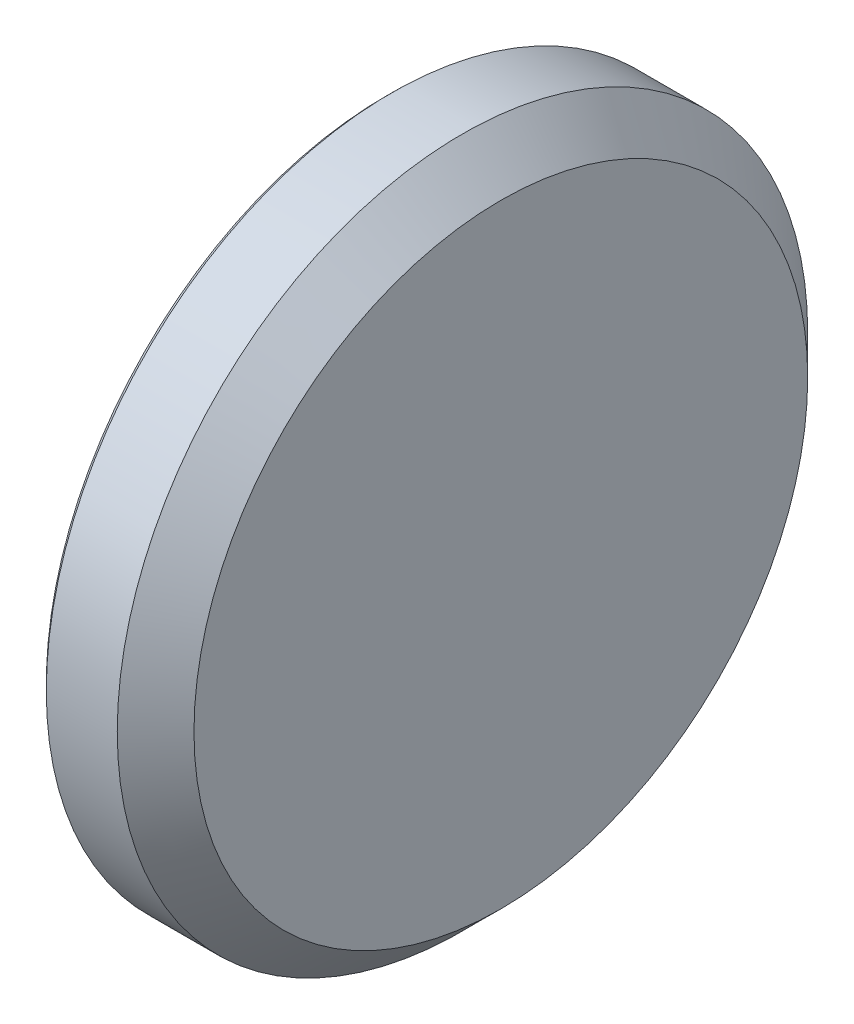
ISO-10303-21;
HEADER;
FILE_DESCRIPTION(('STEP AP214'),'2;1');
FILE_NAME('part.step','',(''),(''),'','','');
FILE_SCHEMA(('AUTOMOTIVE_DESIGN { 1 0 10303 214 1 1 1 1 }'));
ENDSEC;
DATA;
#1=APPLICATION_CONTEXT('core data for automotive mechanical design processes');
#2=APPLICATION_PROTOCOL_DEFINITION('international standard','automotive_design',2000,#1);
#3=PRODUCT_CONTEXT('',#1,'mechanical');
#4=PRODUCT('Part','Part','',(#3));
#5=PRODUCT_RELATED_PRODUCT_CATEGORY('part','',(#4));
#6=PRODUCT_DEFINITION_FORMATION('','',#4);
#7=PRODUCT_DEFINITION_CONTEXT('part definition',#1,'design');
#8=PRODUCT_DEFINITION('design','',#6,#7);
#9=PRODUCT_DEFINITION_SHAPE('','',#8);
#10=(LENGTH_UNIT() NAMED_UNIT(*) SI_UNIT(.MILLI.,.METRE.));
#11=(NAMED_UNIT(*) PLANE_ANGLE_UNIT() SI_UNIT($,.RADIAN.));
#12=(NAMED_UNIT(*) SI_UNIT($,.STERADIAN.) SOLID_ANGLE_UNIT());
#13=UNCERTAINTY_MEASURE_WITH_UNIT(LENGTH_MEASURE(1.E-05),#10,'distance_accuracy_value','');
#14=(GEOMETRIC_REPRESENTATION_CONTEXT(3) GLOBAL_UNCERTAINTY_ASSIGNED_CONTEXT((#13)) GLOBAL_UNIT_ASSIGNED_CONTEXT((#10,
#11,#12)) REPRESENTATION_CONTEXT('',''));
#15=CARTESIAN_POINT('',(0.,0.,0.));
#16=DIRECTION('',(0.,0.,1.));
#17=DIRECTION('',(1.,0.,0.));
#18=AXIS2_PLACEMENT_3D('',#15,#16,#17);
#19=CARTESIAN_POINT('',(3.,0.,0.));
#20=DIRECTION('',(-1.,0.,0.));
#21=DIRECTION('',(0.,0.,1.));
#22=AXIS2_PLACEMENT_3D('',#19,#20,#21);
#23=CYLINDRICAL_SURFACE('',#22,9.);
#24=CARTESIAN_POINT('',(0.149999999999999,0.,0.));
#25=DIRECTION('',(1.,0.,0.));
#26=DIRECTION('',(0.,0.,-1.));
#27=AXIS2_PLACEMENT_3D('',#24,#25,#26);
#28=CIRCLE('',#27,9.);
#29=CARTESIAN_POINT('',(0.149999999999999,0.,-9.));
#30=VERTEX_POINT('',#29);
#31=EDGE_CURVE('E36',#30,#30,#28,.T.);
#32=ORIENTED_EDGE('',*,*,#31,.T.);
#33=EDGE_LOOP('',(#32));
#34=FACE_BOUND('',#33,.T.);
#35=CARTESIAN_POINT('',(2.,0.,0.));
#36=DIRECTION('',(1.,0.,0.));
#37=DIRECTION('',(0.,0.,-1.));
#38=AXIS2_PLACEMENT_3D('',#35,#36,#37);
#39=CIRCLE('',#38,9.);
#40=CARTESIAN_POINT('',(2.,0.,-9.));
#41=VERTEX_POINT('',#40);
#42=EDGE_CURVE('E40',#41,#41,#39,.F.);
#43=ORIENTED_EDGE('',*,*,#42,.T.);
#44=EDGE_LOOP('',(#43));
#45=FACE_BOUND('',#44,.T.);
#46=ADVANCED_FACE('F29',(#34,#45),#23,.T.);
#47=CARTESIAN_POINT('',(3.,0.,0.));
#48=DIRECTION('',(1.,0.,0.));
#49=DIRECTION('',(0.,0.,-1.));
#50=AXIS2_PLACEMENT_3D('',#47,#48,#49);
#51=PLANE('',#50);
#52=CARTESIAN_POINT('',(3.,0.,0.));
#53=DIRECTION('',(1.,0.,0.));
#54=DIRECTION('',(0.,0.,-1.));
#55=AXIS2_PLACEMENT_3D('',#52,#53,#54);
#56=CIRCLE('',#55,8.);
#57=CARTESIAN_POINT('',(3.,0.,-8.));
#58=VERTEX_POINT('',#57);
#59=EDGE_CURVE('E44',#58,#58,#56,.T.);
#60=ORIENTED_EDGE('',*,*,#59,.T.);
#61=EDGE_LOOP('',(#60));
#62=FACE_BOUND('',#61,.T.);
#63=ADVANCED_FACE('F50',(#62),#51,.T.);
#64=CARTESIAN_POINT('',(0.,0.,0.));
#65=DIRECTION('',(1.,0.,0.));
#66=DIRECTION('',(0.,0.,-1.));
#67=AXIS2_PLACEMENT_3D('',#64,#65,#66);
#68=PLANE('',#67);
#69=CARTESIAN_POINT('',(0.,0.,0.));
#70=DIRECTION('',(1.,0.,0.));
#71=DIRECTION('',(0.,0.,-1.));
#72=AXIS2_PLACEMENT_3D('',#69,#70,#71);
#73=CIRCLE('',#72,8.85);
#74=CARTESIAN_POINT('',(0.,0.,-8.85));
#75=VERTEX_POINT('',#74);
#76=EDGE_CURVE('E10',#75,#75,#73,.F.);
#77=ORIENTED_EDGE('',*,*,#76,.T.);
#78=EDGE_LOOP('',(#77));
#79=FACE_BOUND('',#78,.T.);
#80=ADVANCED_FACE('F54',(#79),#68,.F.);
#81=CARTESIAN_POINT('',(3.,0.,0.));
#82=DIRECTION('',(-1.,0.,0.));
#83=DIRECTION('',(0.,0.,1.));
#84=AXIS2_PLACEMENT_3D('',#81,#82,#83);
#85=CONICAL_SURFACE('',#84,8.,0.785398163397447);
#86=ORIENTED_EDGE('',*,*,#42,.F.);
#87=EDGE_LOOP('',(#86));
#88=FACE_BOUND('',#87,.T.);
#89=ORIENTED_EDGE('',*,*,#59,.F.);
#90=EDGE_LOOP('',(#89));
#91=FACE_BOUND('',#90,.T.);
#92=ADVANCED_FACE('F52',(#88,#91),#85,.T.);
#93=CARTESIAN_POINT('',(0.149999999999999,0.,0.));
#94=DIRECTION('',(1.,0.,0.));
#95=DIRECTION('',(0.,0.,-1.));
#96=AXIS2_PLACEMENT_3D('',#93,#94,#95);
#97=CONICAL_SURFACE('',#96,9.,0.785398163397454);
#98=ORIENTED_EDGE('',*,*,#76,.F.);
#99=EDGE_LOOP('',(#98));
#100=FACE_BOUND('',#99,.T.);
#101=ORIENTED_EDGE('',*,*,#31,.F.);
#102=EDGE_LOOP('',(#101));
#103=FACE_BOUND('',#102,.T.);
#104=ADVANCED_FACE('F31',(#100,#103),#97,.T.);
#105=CLOSED_SHELL('',(#46,#63,#80,#92,#104));
#106=MANIFOLD_SOLID_BREP('B2',#105);
#107=ADVANCED_BREP_SHAPE_REPRESENTATION('',(#18,#106),#14);
#108=SHAPE_DEFINITION_REPRESENTATION(#9,#107);
ENDSEC;
END-ISO-10303-21;
